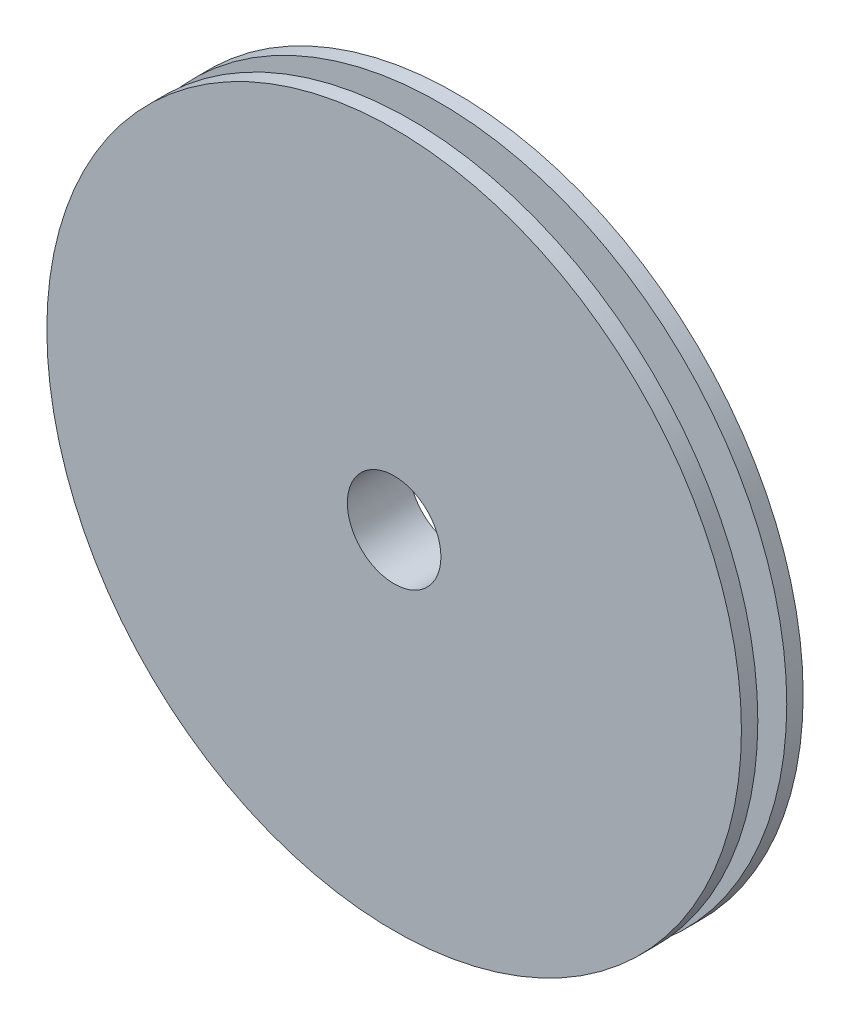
from build123d import *

# Parameters (mm, degrees)
SKETCH1_R               = 18
BOSS_EXTRUDE1_DEPTH     = 3.2
CUT_EXTRUDE1_DEPTH      = 17
CUT_EXTRUDE1_DEPTH_BACK = 43
SKETCH2_R               = 2.425
SKETCH5_R               = 18
SKETCH5_R_2             = 15.5
CUT_EXTRUDE4_DEPTH      = 0.75


with BuildPart() as part:
    # Sketch1 → Boss-Extrude1 (new body)
    with BuildSketch(Plane.XY):
        Circle(SKETCH1_R)
    extrude(amount=BOSS_EXTRUDE1_DEPTH)

    # Sketch2 → Cut-Extrude1 (cut, two sides: drawn at the far end of the back side and taken through both)
    with BuildSketch(Plane.XY.offset(3.2).offset(-CUT_EXTRUDE1_DEPTH_BACK)):
        Circle(SKETCH2_R)
    extrude(amount=CUT_EXTRUDE1_DEPTH + CUT_EXTRUDE1_DEPTH_BACK, mode=Mode.SUBTRACT)

    # Sketch5 → Cut-Extrude4 (cut, symmetric)
    with BuildSketch(Plane.XY.offset(1.6)):
        Circle(SKETCH5_R)
        Circle(SKETCH5_R_2, mode=Mode.SUBTRACT)
    extrude(amount=CUT_EXTRUDE4_DEPTH, both=True, mode=Mode.SUBTRACT)


solid = part.part
